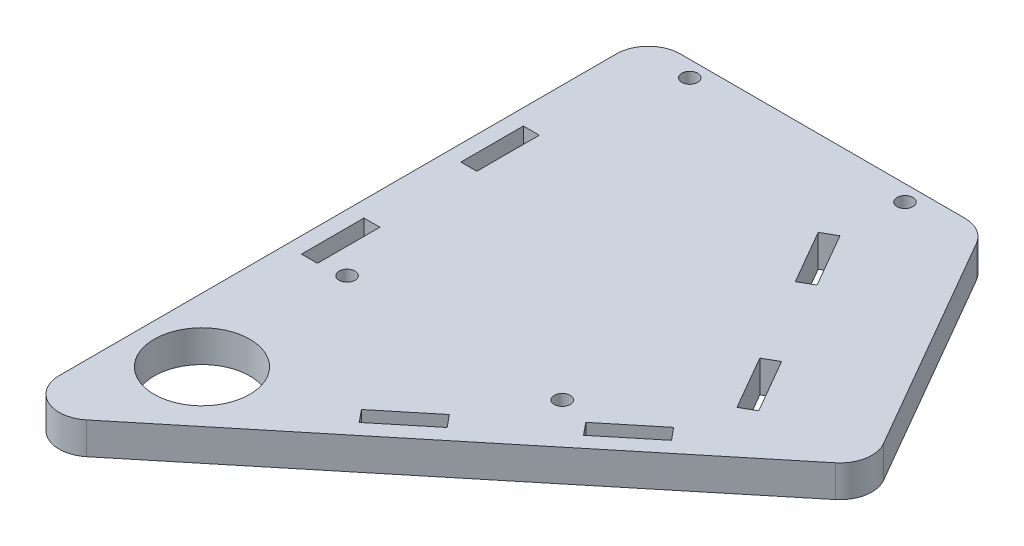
ISO-10303-21;
HEADER;
FILE_DESCRIPTION(('STEP AP214'),'2;1');
FILE_NAME('part.step','',(''),(''),'','','');
FILE_SCHEMA(('AUTOMOTIVE_DESIGN { 1 0 10303 214 1 1 1 1 }'));
ENDSEC;
DATA;
#1=APPLICATION_CONTEXT('core data for automotive mechanical design processes');
#2=APPLICATION_PROTOCOL_DEFINITION('international standard','automotive_design',2000,#1);
#3=PRODUCT_CONTEXT('',#1,'mechanical');
#4=PRODUCT('Part','Part','',(#3));
#5=PRODUCT_RELATED_PRODUCT_CATEGORY('part','',(#4));
#6=PRODUCT_DEFINITION_FORMATION('','',#4);
#7=PRODUCT_DEFINITION_CONTEXT('part definition',#1,'design');
#8=PRODUCT_DEFINITION('design','',#6,#7);
#9=PRODUCT_DEFINITION_SHAPE('','',#8);
#10=(LENGTH_UNIT() NAMED_UNIT(*) SI_UNIT(.MILLI.,.METRE.));
#11=(NAMED_UNIT(*) PLANE_ANGLE_UNIT() SI_UNIT($,.RADIAN.));
#12=(NAMED_UNIT(*) SI_UNIT($,.STERADIAN.) SOLID_ANGLE_UNIT());
#13=UNCERTAINTY_MEASURE_WITH_UNIT(LENGTH_MEASURE(1.E-05),#10,'distance_accuracy_value','');
#14=(GEOMETRIC_REPRESENTATION_CONTEXT(3) GLOBAL_UNCERTAINTY_ASSIGNED_CONTEXT((#13)) GLOBAL_UNIT_ASSIGNED_CONTEXT((#10,
#11,#12)) REPRESENTATION_CONTEXT('',''));
#15=CARTESIAN_POINT('',(0.,0.,0.));
#16=DIRECTION('',(0.,0.,1.));
#17=DIRECTION('',(1.,0.,0.));
#18=AXIS2_PLACEMENT_3D('',#15,#16,#17);
#19=CARTESIAN_POINT('',(-146.05,6.35,-187.458546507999));
#20=DIRECTION('',(0.,1.,0.));
#21=DIRECTION('',(0.,0.,1.));
#22=AXIS2_PLACEMENT_3D('',#19,#20,#21);
#23=PLANE('',#22);
#24=DIRECTION('',(0.633888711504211,0.,0.773424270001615));
#25=VECTOR('',#24,1.);
#26=CARTESIAN_POINT('',(-91.8981940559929,6.35,-231.840679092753));
#27=LINE('',#26,#25);
#28=CARTESIAN_POINT('',(-91.8981940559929,6.35,-231.840679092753));
#29=VERTEX_POINT('',#28);
#30=CARTESIAN_POINT('',(-89.8855973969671,6.35,-229.385057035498));
#31=VERTEX_POINT('',#30);
#32=EDGE_CURVE('E278',#29,#31,#27,.T.);
#33=ORIENTED_EDGE('',*,*,#32,.F.);
#34=DIRECTION('',(-0.773424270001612,0.,0.633888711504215));
#35=VECTOR('',#34,1.);
#36=CARTESIAN_POINT('',(-82.2721555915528,6.35,-239.730057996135));
#37=LINE('',#36,#35);
#38=CARTESIAN_POINT('',(-82.2721555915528,6.35,-239.730057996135));
#39=VERTEX_POINT('',#38);
#40=EDGE_CURVE('E276',#39,#29,#37,.T.);
#41=ORIENTED_EDGE('',*,*,#40,.F.);
#42=DIRECTION('',(-0.633888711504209,0.,-0.773424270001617));
#43=VECTOR('',#42,1.);
#44=CARTESIAN_POINT('',(-82.2721555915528,6.35,-239.730057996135));
#45=LINE('',#44,#43);
#46=CARTESIAN_POINT('',(-80.259558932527,6.35,-237.27443593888));
#47=VERTEX_POINT('',#46);
#48=EDGE_CURVE('E284',#47,#39,#45,.T.);
#49=ORIENTED_EDGE('',*,*,#48,.F.);
#50=DIRECTION('',(0.773424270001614,0.,-0.633888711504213));
#51=VECTOR('',#50,1.);
#52=CARTESIAN_POINT('',(-80.259558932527,6.35,-237.27443593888));
#53=LINE('',#52,#51);
#54=EDGE_CURVE('E281',#31,#47,#53,.T.);
#55=ORIENTED_EDGE('',*,*,#54,.F.);
#56=EDGE_LOOP('',(#33,#41,#49,#55));
#57=FACE_BOUND('',#56,.T.);
#58=DIRECTION('',(0.866025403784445,0.,-0.499999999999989));
#59=VECTOR('',#58,1.);
#60=CARTESIAN_POINT('',(-95.2945841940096,6.35,-276.968554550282));
#61=LINE('',#60,#59);
#62=CARTESIAN_POINT('',(-95.2945841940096,6.35,-276.968554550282));
#63=VERTEX_POINT('',#62);
#64=CARTESIAN_POINT('',(-92.544953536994,6.35,-278.556054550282));
#65=VERTEX_POINT('',#64);
#66=EDGE_CURVE('E340',#63,#65,#61,.T.);
#67=ORIENTED_EDGE('',*,*,#66,.F.);
#68=DIRECTION('',(0.500000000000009,0.,0.866025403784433));
#69=VECTOR('',#68,1.);
#70=CARTESIAN_POINT('',(-101.51758419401,6.35,-287.747106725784));
#71=LINE('',#70,#69);
#72=CARTESIAN_POINT('',(-101.51758419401,6.35,-287.747106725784));
#73=VERTEX_POINT('',#72);
#74=EDGE_CURVE('E338',#73,#63,#71,.T.);
#75=ORIENTED_EDGE('',*,*,#74,.F.);
#76=DIRECTION('',(-0.866025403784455,0.,0.499999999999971));
#77=VECTOR('',#76,1.);
#78=CARTESIAN_POINT('',(-101.51758419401,6.35,-287.747106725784));
#79=LINE('',#78,#77);
#80=CARTESIAN_POINT('',(-98.7679535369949,6.35,-289.334606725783));
#81=VERTEX_POINT('',#80);
#82=EDGE_CURVE('E346',#81,#73,#79,.T.);
#83=ORIENTED_EDGE('',*,*,#82,.F.);
#84=DIRECTION('',(-0.500000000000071,0.,-0.866025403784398));
#85=VECTOR('',#84,1.);
#86=CARTESIAN_POINT('',(-98.7679535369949,6.35,-289.334606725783));
#87=LINE('',#86,#85);
#88=EDGE_CURVE('E343',#65,#81,#87,.T.);
#89=ORIENTED_EDGE('',*,*,#88,.F.);
#90=EDGE_LOOP('',(#67,#75,#83,#89));
#91=FACE_BOUND('',#90,.T.);
#92=DIRECTION('',(1.,0.,2.09805925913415E-13));
#93=VECTOR('',#92,1.);
#94=CARTESIAN_POINT('',(-149.225000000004,6.35,-264.296354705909));
#95=LINE('',#94,#93);
#96=CARTESIAN_POINT('',(-149.225000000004,6.35,-264.296354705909));
#97=VERTEX_POINT('',#96);
#98=CARTESIAN_POINT('',(-146.050000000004,6.35,-264.296354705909));
#99=VERTEX_POINT('',#98);
#100=EDGE_CURVE('E402',#97,#99,#95,.T.);
#101=ORIENTED_EDGE('',*,*,#100,.F.);
#102=DIRECTION('',(0.,0.,1.));
#103=VECTOR('',#102,1.);
#104=CARTESIAN_POINT('',(-149.225000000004,6.35,-276.742354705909));
#105=LINE('',#104,#103);
#106=CARTESIAN_POINT('',(-149.225000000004,6.35,-276.742354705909));
#107=VERTEX_POINT('',#106);
#108=EDGE_CURVE('E400',#107,#97,#105,.T.);
#109=ORIENTED_EDGE('',*,*,#108,.F.);
#110=DIRECTION('',(-1.,0.,-1.92322098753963E-13));
#111=VECTOR('',#110,1.);
#112=CARTESIAN_POINT('',(-149.225000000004,6.35,-276.742354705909));
#113=LINE('',#112,#111);
#114=CARTESIAN_POINT('',(-146.050000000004,6.35,-276.742354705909));
#115=VERTEX_POINT('',#114);
#116=EDGE_CURVE('E408',#115,#107,#113,.T.);
#117=ORIENTED_EDGE('',*,*,#116,.F.);
#118=DIRECTION('',(0.,0.,-1.));
#119=VECTOR('',#118,1.);
#120=CARTESIAN_POINT('',(-146.050000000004,6.35,-276.742354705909));
#121=LINE('',#120,#119);
#122=EDGE_CURVE('E405',#99,#115,#121,.T.);
#123=ORIENTED_EDGE('',*,*,#122,.F.);
#124=EDGE_LOOP('',(#101,#109,#117,#123));
#125=FACE_BOUND('',#124,.T.);
#126=CARTESIAN_POINT('',(-98.1075000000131,6.35,-233.362500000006));
#127=DIRECTION('',(0.,1.,0.));
#128=DIRECTION('',(0.,0.,1.));
#129=AXIS2_PLACEMENT_3D('',#126,#127,#128);
#130=CIRCLE('',#129,1.5875);
#131=CARTESIAN_POINT('',(-98.1075000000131,6.35,-231.775000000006));
#132=VERTEX_POINT('',#131);
#133=EDGE_CURVE('E437',#132,#132,#130,.T.);
#134=ORIENTED_EDGE('',*,*,#133,.F.);
#135=EDGE_LOOP('',(#134));
#136=FACE_BOUND('',#135,.T.);
#137=CARTESIAN_POINT('',(-140.970000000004,6.35,-233.362500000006));
#138=DIRECTION('',(0.,1.,0.));
#139=DIRECTION('',(0.,0.,1.));
#140=AXIS2_PLACEMENT_3D('',#137,#138,#139);
#141=CIRCLE('',#140,1.58749999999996);
#142=CARTESIAN_POINT('',(-140.970000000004,6.35,-231.775000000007));
#143=VERTEX_POINT('',#142);
#144=EDGE_CURVE('E449',#143,#143,#141,.T.);
#145=ORIENTED_EDGE('',*,*,#144,.F.);
#146=EDGE_LOOP('',(#145));
#147=FACE_BOUND('',#146,.T.);
#148=CARTESIAN_POINT('',(-146.05,6.35,-187.458546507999));
#149=DIRECTION('',(0.,1.,0.));
#150=DIRECTION('',(0.,0.,1.));
#151=AXIS2_PLACEMENT_3D('',#148,#149,#150);
#152=CIRCLE('',#151,6.34999999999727);
#153=CARTESIAN_POINT('',(-152.4,6.35,-187.458546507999));
#154=VERTEX_POINT('',#153);
#155=CARTESIAN_POINT('',(-142.024806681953,6.35,-182.547302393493));
#156=VERTEX_POINT('',#155);
#157=EDGE_CURVE('E461',#154,#156,#152,.T.);
#158=ORIENTED_EDGE('',*,*,#157,.T.);
#159=DIRECTION('',(0.773424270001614,0.,-0.633888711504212));
#160=VECTOR('',#159,1.);
#161=CARTESIAN_POINT('',(-130.626546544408,6.35,-191.889171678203));
#162=LINE('',#161,#160);
#163=CARTESIAN_POINT('',(-60.0496370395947,6.35,-249.733110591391));
#164=VERTEX_POINT('',#163);
#165=EDGE_CURVE('E464',#156,#164,#162,.T.);
#166=ORIENTED_EDGE('',*,*,#165,.T.);
#167=CARTESIAN_POINT('',(-64.0748303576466,6.35,-254.644354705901));
#168=DIRECTION('',(0.,1.,0.));
#169=DIRECTION('',(0.,0.,-1.));
#170=AXIS2_PLACEMENT_3D('',#167,#168,#169);
#171=CIRCLE('',#170,6.35000000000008);
#172=CARTESIAN_POINT('',(-58.5755690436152,6.35,-257.819354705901));
#173=VERTEX_POINT('',#172);
#174=EDGE_CURVE('E467',#164,#173,#171,.T.);
#175=ORIENTED_EDGE('',*,*,#174,.T.);
#176=DIRECTION('',(-0.499999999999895,0.,-0.866025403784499));
#177=VECTOR('',#176,1.);
#178=CARTESIAN_POINT('',(-58.5755690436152,6.35,-257.819354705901));
#179=LINE('',#178,#177);
#180=CARTESIAN_POINT('',(-83.866770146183,6.35,-301.625000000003));
#181=VERTEX_POINT('',#180);
#182=EDGE_CURVE('E469',#173,#181,#179,.T.);
#183=ORIENTED_EDGE('',*,*,#182,.T.);
#184=CARTESIAN_POINT('',(-89.3660314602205,6.35,-298.449999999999));
#185=DIRECTION('',(0.,1.,0.));
#186=DIRECTION('',(0.,0.,-1.));
#187=AXIS2_PLACEMENT_3D('',#184,#185,#186);
#188=CIRCLE('',#187,6.35000000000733);
#189=CARTESIAN_POINT('',(-89.366031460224,6.35,-304.800000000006));
#190=VERTEX_POINT('',#189);
#191=EDGE_CURVE('E471',#181,#190,#188,.T.);
#192=ORIENTED_EDGE('',*,*,#191,.T.);
#193=DIRECTION('',(-1.,0.,0.));
#194=VECTOR('',#193,1.);
#195=CARTESIAN_POINT('',(-146.050000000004,6.35,-304.800000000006));
#196=LINE('',#195,#194);
#197=CARTESIAN_POINT('',(-146.050000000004,6.35,-304.800000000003));
#198=VERTEX_POINT('',#197);
#199=EDGE_CURVE('E473',#190,#198,#196,.T.);
#200=ORIENTED_EDGE('',*,*,#199,.T.);
#201=CARTESIAN_POINT('',(-146.05,6.35,-298.45));
#202=DIRECTION('',(0.,1.,0.));
#203=DIRECTION('',(0.,0.,-1.));
#204=AXIS2_PLACEMENT_3D('',#201,#202,#203);
#205=CIRCLE('',#204,6.35000000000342);
#206=CARTESIAN_POINT('',(-152.4,6.35,-298.45));
#207=VERTEX_POINT('',#206);
#208=EDGE_CURVE('E475',#198,#207,#205,.T.);
#209=ORIENTED_EDGE('',*,*,#208,.T.);
#210=DIRECTION('',(0.,0.,1.));
#211=VECTOR('',#210,1.);
#212=CARTESIAN_POINT('',(-152.4,6.35,-187.458546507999));
#213=LINE('',#212,#211);
#214=EDGE_CURVE('E477',#207,#154,#213,.T.);
#215=ORIENTED_EDGE('',*,*,#214,.T.);
#216=EDGE_LOOP('',(#158,#166,#175,#183,#192,#200,#209,#215));
#217=FACE_BOUND('',#216,.T.);
#218=CARTESIAN_POINT('',(-140.970000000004,6.35,-301.625000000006));
#219=DIRECTION('',(0.,1.,0.));
#220=DIRECTION('',(0.,0.,1.));
#221=AXIS2_PLACEMENT_3D('',#218,#219,#220);
#222=CIRCLE('',#221,1.58749999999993);
#223=CARTESIAN_POINT('',(-140.970000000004,6.35,-300.037500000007));
#224=VERTEX_POINT('',#223);
#225=EDGE_CURVE('E455',#224,#224,#222,.T.);
#226=ORIENTED_EDGE('',*,*,#225,.F.);
#227=EDGE_LOOP('',(#226));
#228=FACE_BOUND('',#227,.T.);
#229=CARTESIAN_POINT('',(-98.1075000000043,6.35,-301.625000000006));
#230=DIRECTION('',(0.,1.,0.));
#231=DIRECTION('',(0.,0.,1.));
#232=AXIS2_PLACEMENT_3D('',#229,#230,#231);
#233=CIRCLE('',#232,1.58749999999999);
#234=CARTESIAN_POINT('',(-98.1075000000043,6.35,-300.037500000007));
#235=VERTEX_POINT('',#234);
#236=EDGE_CURVE('E443',#235,#235,#233,.T.);
#237=ORIENTED_EDGE('',*,*,#236,.F.);
#238=EDGE_LOOP('',(#237));
#239=FACE_BOUND('',#238,.T.);
#240=CARTESIAN_POINT('',(-139.700000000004,6.35,-203.200000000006));
#241=DIRECTION('',(0.,1.,0.));
#242=DIRECTION('',(0.,0.,1.));
#243=AXIS2_PLACEMENT_3D('',#240,#241,#242);
#244=CIRCLE('',#243,9.52499999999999);
#245=CARTESIAN_POINT('',(-139.700000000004,6.35,-193.675000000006));
#246=VERTEX_POINT('',#245);
#247=EDGE_CURVE('E431',#246,#246,#244,.T.);
#248=ORIENTED_EDGE('',*,*,#247,.F.);
#249=EDGE_LOOP('',(#248));
#250=FACE_BOUND('',#249,.T.);
#251=DIRECTION('',(0.,0.,-1.));
#252=VECTOR('',#251,1.);
#253=CARTESIAN_POINT('',(-146.050000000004,6.35,-232.546354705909));
#254=LINE('',#253,#252);
#255=CARTESIAN_POINT('',(-146.050000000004,6.35,-232.546354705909));
#256=VERTEX_POINT('',#255);
#257=CARTESIAN_POINT('',(-146.050000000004,6.35,-244.992354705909));
#258=VERTEX_POINT('',#257);
#259=EDGE_CURVE('E371',#256,#258,#254,.T.);
#260=ORIENTED_EDGE('',*,*,#259,.F.);
#261=DIRECTION('',(1.,0.,2.36031666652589E-13));
#262=VECTOR('',#261,1.);
#263=CARTESIAN_POINT('',(-149.225000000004,6.35,-232.546354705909));
#264=LINE('',#263,#262);
#265=CARTESIAN_POINT('',(-149.225000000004,6.35,-232.546354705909));
#266=VERTEX_POINT('',#265);
#267=EDGE_CURVE('E369',#266,#256,#264,.T.);
#268=ORIENTED_EDGE('',*,*,#267,.F.);
#269=DIRECTION('',(0.,0.,1.));
#270=VECTOR('',#269,1.);
#271=CARTESIAN_POINT('',(-149.225000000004,6.35,-232.546354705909));
#272=LINE('',#271,#270);
#273=CARTESIAN_POINT('',(-149.225000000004,6.35,-244.992354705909));
#274=VERTEX_POINT('',#273);
#275=EDGE_CURVE('E377',#274,#266,#272,.T.);
#276=ORIENTED_EDGE('',*,*,#275,.F.);
#277=DIRECTION('',(-1.,0.,-2.09805925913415E-13));
#278=VECTOR('',#277,1.);
#279=CARTESIAN_POINT('',(-149.225000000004,6.35,-244.992354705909));
#280=LINE('',#279,#278);
#281=EDGE_CURVE('E374',#258,#274,#280,.T.);
#282=ORIENTED_EDGE('',*,*,#281,.F.);
#283=EDGE_LOOP('',(#260,#268,#276,#282));
#284=FACE_BOUND('',#283,.T.);
#285=DIRECTION('',(-0.499999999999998,0.,-0.86602540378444));
#286=VECTOR('',#285,1.);
#287=CARTESIAN_POINT('',(-76.6699535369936,6.35,-251.059747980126));
#288=LINE('',#287,#286);
#289=CARTESIAN_POINT('',(-76.6699535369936,6.35,-251.059747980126));
#290=VERTEX_POINT('',#289);
#291=CARTESIAN_POINT('',(-82.8929535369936,6.35,-261.838300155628));
#292=VERTEX_POINT('',#291);
#293=EDGE_CURVE('E309',#290,#292,#288,.T.);
#294=ORIENTED_EDGE('',*,*,#293,.F.);
#295=DIRECTION('',(0.866025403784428,0.,-0.500000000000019));
#296=VECTOR('',#295,1.);
#297=CARTESIAN_POINT('',(-79.4195841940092,6.35,-249.472247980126));
#298=LINE('',#297,#296);
#299=CARTESIAN_POINT('',(-79.4195841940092,6.35,-249.472247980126));
#300=VERTEX_POINT('',#299);
#301=EDGE_CURVE('E307',#300,#290,#298,.T.);
#302=ORIENTED_EDGE('',*,*,#301,.F.);
#303=DIRECTION('',(0.500000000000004,0.,0.866025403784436));
#304=VECTOR('',#303,1.);
#305=CARTESIAN_POINT('',(-79.4195841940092,6.35,-249.472247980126));
#306=LINE('',#305,#304);
#307=CARTESIAN_POINT('',(-85.6425841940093,6.35,-260.250800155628));
#308=VERTEX_POINT('',#307);
#309=EDGE_CURVE('E315',#308,#300,#306,.T.);
#310=ORIENTED_EDGE('',*,*,#309,.F.);
#311=DIRECTION('',(-0.866025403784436,0.,0.500000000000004));
#312=VECTOR('',#311,1.);
#313=CARTESIAN_POINT('',(-85.6425841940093,6.35,-260.250800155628));
#314=LINE('',#313,#312);
#315=EDGE_CURVE('E312',#292,#308,#314,.T.);
#316=ORIENTED_EDGE('',*,*,#315,.F.);
#317=EDGE_LOOP('',(#294,#302,#310,#316));
#318=FACE_BOUND('',#317,.T.);
#319=DIRECTION('',(0.773424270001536,0.,-0.633888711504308));
#320=VECTOR('',#319,1.);
#321=CARTESIAN_POINT('',(-114.441817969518,6.35,-209.25909044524));
#322=LINE('',#321,#320);
#323=CARTESIAN_POINT('',(-114.441817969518,6.35,-209.25909044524));
#324=VERTEX_POINT('',#323);
#325=CARTESIAN_POINT('',(-104.815779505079,6.35,-217.148469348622));
#326=VERTEX_POINT('',#325);
#327=EDGE_CURVE('E248',#324,#326,#322,.T.);
#328=ORIENTED_EDGE('',*,*,#327,.F.);
#329=DIRECTION('',(0.633888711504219,0.,0.773424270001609));
#330=VECTOR('',#329,1.);
#331=CARTESIAN_POINT('',(-116.454414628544,6.35,-211.714712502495));
#332=LINE('',#331,#330);
#333=CARTESIAN_POINT('',(-116.454414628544,6.35,-211.714712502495));
#334=VERTEX_POINT('',#333);
#335=EDGE_CURVE('E240',#334,#324,#332,.T.);
#336=ORIENTED_EDGE('',*,*,#335,.F.);
#337=DIRECTION('',(-0.773424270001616,0.,0.63388871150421));
#338=VECTOR('',#337,1.);
#339=CARTESIAN_POINT('',(-116.454414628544,6.35,-211.714712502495));
#340=LINE('',#339,#338);
#341=CARTESIAN_POINT('',(-106.828376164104,6.35,-219.604091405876));
#342=VERTEX_POINT('',#341);
#343=EDGE_CURVE('E262',#342,#334,#340,.T.);
#344=ORIENTED_EDGE('',*,*,#343,.F.);
#345=DIRECTION('',(-0.633888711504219,0.,-0.773424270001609));
#346=VECTOR('',#345,1.);
#347=CARTESIAN_POINT('',(-106.828376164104,6.35,-219.604091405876));
#348=LINE('',#347,#346);
#349=EDGE_CURVE('E260',#326,#342,#348,.T.);
#350=ORIENTED_EDGE('',*,*,#349,.F.);
#351=EDGE_LOOP('',(#328,#336,#344,#350));
#352=FACE_BOUND('',#351,.T.);
#353=ADVANCED_FACE('F31',(#57,#91,#125,#136,#147,#217,#228,#239,#250,#284,#318,#352),#23,.T.);
#354=CARTESIAN_POINT('',(-146.05,0.,-187.458546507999));
#355=DIRECTION('',(0.,1.,0.));
#356=DIRECTION('',(0.,0.,1.));
#357=AXIS2_PLACEMENT_3D('',#354,#355,#356);
#358=PLANE('',#357);
#359=DIRECTION('',(-0.773424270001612,0.,0.633888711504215));
#360=VECTOR('',#359,1.);
#361=CARTESIAN_POINT('',(-82.2721555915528,0.,-239.730057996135));
#362=LINE('',#361,#360);
#363=CARTESIAN_POINT('',(-82.2721555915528,0.,-239.730057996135));
#364=VERTEX_POINT('',#363);
#365=CARTESIAN_POINT('',(-91.8981940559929,0.,-231.840679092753));
#366=VERTEX_POINT('',#365);
#367=EDGE_CURVE('E256',#364,#366,#362,.T.);
#368=ORIENTED_EDGE('',*,*,#367,.T.);
#369=DIRECTION('',(0.633888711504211,0.,0.773424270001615));
#370=VECTOR('',#369,1.);
#371=CARTESIAN_POINT('',(-91.8981940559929,0.,-231.840679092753));
#372=LINE('',#371,#370);
#373=CARTESIAN_POINT('',(-89.8855973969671,0.,-229.385057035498));
#374=VERTEX_POINT('',#373);
#375=EDGE_CURVE('E289',#366,#374,#372,.T.);
#376=ORIENTED_EDGE('',*,*,#375,.T.);
#377=DIRECTION('',(0.773424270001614,0.,-0.633888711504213));
#378=VECTOR('',#377,1.);
#379=CARTESIAN_POINT('',(-80.259558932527,0.,-237.27443593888));
#380=LINE('',#379,#378);
#381=CARTESIAN_POINT('',(-80.259558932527,0.,-237.27443593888));
#382=VERTEX_POINT('',#381);
#383=EDGE_CURVE('E292',#374,#382,#380,.T.);
#384=ORIENTED_EDGE('',*,*,#383,.T.);
#385=DIRECTION('',(-0.633888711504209,0.,-0.773424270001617));
#386=VECTOR('',#385,1.);
#387=CARTESIAN_POINT('',(-82.2721555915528,0.,-239.730057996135));
#388=LINE('',#387,#386);
#389=EDGE_CURVE('E279',#382,#364,#388,.T.);
#390=ORIENTED_EDGE('',*,*,#389,.T.);
#391=EDGE_LOOP('',(#368,#376,#384,#390));
#392=FACE_BOUND('',#391,.T.);
#393=DIRECTION('',(0.500000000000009,0.,0.866025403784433));
#394=VECTOR('',#393,1.);
#395=CARTESIAN_POINT('',(-101.51758419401,0.,-287.747106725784));
#396=LINE('',#395,#394);
#397=CARTESIAN_POINT('',(-101.51758419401,0.,-287.747106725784));
#398=VERTEX_POINT('',#397);
#399=CARTESIAN_POINT('',(-95.2945841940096,0.,-276.968554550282));
#400=VERTEX_POINT('',#399);
#401=EDGE_CURVE('E337',#398,#400,#396,.T.);
#402=ORIENTED_EDGE('',*,*,#401,.T.);
#403=DIRECTION('',(0.866025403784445,0.,-0.499999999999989));
#404=VECTOR('',#403,1.);
#405=CARTESIAN_POINT('',(-95.2945841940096,0.,-276.968554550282));
#406=LINE('',#405,#404);
#407=CARTESIAN_POINT('',(-92.544953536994,0.,-278.556054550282));
#408=VERTEX_POINT('',#407);
#409=EDGE_CURVE('E351',#400,#408,#406,.T.);
#410=ORIENTED_EDGE('',*,*,#409,.T.);
#411=DIRECTION('',(-0.500000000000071,0.,-0.866025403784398));
#412=VECTOR('',#411,1.);
#413=CARTESIAN_POINT('',(-98.7679535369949,0.,-289.334606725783));
#414=LINE('',#413,#412);
#415=CARTESIAN_POINT('',(-98.7679535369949,0.,-289.334606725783));
#416=VERTEX_POINT('',#415);
#417=EDGE_CURVE('E354',#408,#416,#414,.T.);
#418=ORIENTED_EDGE('',*,*,#417,.T.);
#419=DIRECTION('',(-0.866025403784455,0.,0.499999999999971));
#420=VECTOR('',#419,1.);
#421=CARTESIAN_POINT('',(-101.51758419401,0.,-287.747106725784));
#422=LINE('',#421,#420);
#423=EDGE_CURVE('E341',#416,#398,#422,.T.);
#424=ORIENTED_EDGE('',*,*,#423,.T.);
#425=EDGE_LOOP('',(#402,#410,#418,#424));
#426=FACE_BOUND('',#425,.T.);
#427=DIRECTION('',(0.,0.,1.));
#428=VECTOR('',#427,1.);
#429=CARTESIAN_POINT('',(-149.225000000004,0.,-276.742354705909));
#430=LINE('',#429,#428);
#431=CARTESIAN_POINT('',(-149.225000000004,0.,-276.742354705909));
#432=VERTEX_POINT('',#431);
#433=CARTESIAN_POINT('',(-149.225000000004,0.,-264.296354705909));
#434=VERTEX_POINT('',#433);
#435=EDGE_CURVE('E399',#432,#434,#430,.T.);
#436=ORIENTED_EDGE('',*,*,#435,.T.);
#437=DIRECTION('',(1.,0.,2.09805925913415E-13));
#438=VECTOR('',#437,1.);
#439=CARTESIAN_POINT('',(-149.225000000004,0.,-264.296354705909));
#440=LINE('',#439,#438);
#441=CARTESIAN_POINT('',(-146.050000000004,0.,-264.296354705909));
#442=VERTEX_POINT('',#441);
#443=EDGE_CURVE('E413',#434,#442,#440,.T.);
#444=ORIENTED_EDGE('',*,*,#443,.T.);
#445=DIRECTION('',(0.,0.,-1.));
#446=VECTOR('',#445,1.);
#447=CARTESIAN_POINT('',(-146.050000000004,0.,-276.742354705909));
#448=LINE('',#447,#446);
#449=CARTESIAN_POINT('',(-146.050000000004,0.,-276.742354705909));
#450=VERTEX_POINT('',#449);
#451=EDGE_CURVE('E416',#442,#450,#448,.T.);
#452=ORIENTED_EDGE('',*,*,#451,.T.);
#453=DIRECTION('',(-1.,0.,-1.92322098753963E-13));
#454=VECTOR('',#453,1.);
#455=CARTESIAN_POINT('',(-149.225000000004,0.,-276.742354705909));
#456=LINE('',#455,#454);
#457=EDGE_CURVE('E403',#450,#432,#456,.T.);
#458=ORIENTED_EDGE('',*,*,#457,.T.);
#459=EDGE_LOOP('',(#436,#444,#452,#458));
#460=FACE_BOUND('',#459,.T.);
#461=CARTESIAN_POINT('',(-98.1075000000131,0.,-233.362500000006));
#462=DIRECTION('',(0.,1.,0.));
#463=DIRECTION('',(0.,0.,1.));
#464=AXIS2_PLACEMENT_3D('',#461,#462,#463);
#465=CIRCLE('',#464,1.5875);
#466=CARTESIAN_POINT('',(-98.1075000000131,0.,-231.775000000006));
#467=VERTEX_POINT('',#466);
#468=EDGE_CURVE('E434',#467,#467,#465,.T.);
#469=ORIENTED_EDGE('',*,*,#468,.T.);
#470=EDGE_LOOP('',(#469));
#471=FACE_BOUND('',#470,.T.);
#472=CARTESIAN_POINT('',(-140.970000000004,0.,-233.362500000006));
#473=DIRECTION('',(0.,1.,0.));
#474=DIRECTION('',(0.,0.,1.));
#475=AXIS2_PLACEMENT_3D('',#472,#473,#474);
#476=CIRCLE('',#475,1.58749999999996);
#477=CARTESIAN_POINT('',(-140.970000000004,0.,-231.775000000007));
#478=VERTEX_POINT('',#477);
#479=EDGE_CURVE('E446',#478,#478,#476,.T.);
#480=ORIENTED_EDGE('',*,*,#479,.T.);
#481=EDGE_LOOP('',(#480));
#482=FACE_BOUND('',#481,.T.);
#483=CARTESIAN_POINT('',(-146.05,0.,-187.458546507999));
#484=DIRECTION('',(0.,1.,0.));
#485=DIRECTION('',(0.,0.,1.));
#486=AXIS2_PLACEMENT_3D('',#483,#484,#485);
#487=CIRCLE('',#486,6.34999999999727);
#488=CARTESIAN_POINT('',(-152.4,0.,-187.458546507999));
#489=VERTEX_POINT('',#488);
#490=CARTESIAN_POINT('',(-142.024806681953,0.,-182.547302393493));
#491=VERTEX_POINT('',#490);
#492=EDGE_CURVE('E458',#489,#491,#487,.T.);
#493=ORIENTED_EDGE('',*,*,#492,.F.);
#494=DIRECTION('',(0.,0.,1.));
#495=VECTOR('',#494,1.);
#496=CARTESIAN_POINT('',(-152.4,0.,-187.458546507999));
#497=LINE('',#496,#495);
#498=CARTESIAN_POINT('',(-152.4,0.,-298.45));
#499=VERTEX_POINT('',#498);
#500=EDGE_CURVE('E465',#499,#489,#497,.T.);
#501=ORIENTED_EDGE('',*,*,#500,.F.);
#502=CARTESIAN_POINT('',(-146.05,0.,-298.45));
#503=DIRECTION('',(0.,1.,0.));
#504=DIRECTION('',(0.,0.,-1.));
#505=AXIS2_PLACEMENT_3D('',#502,#503,#504);
#506=CIRCLE('',#505,6.35000000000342);
#507=CARTESIAN_POINT('',(-146.050000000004,0.,-304.800000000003));
#508=VERTEX_POINT('',#507);
#509=EDGE_CURVE('E492',#508,#499,#506,.T.);
#510=ORIENTED_EDGE('',*,*,#509,.F.);
#511=DIRECTION('',(-1.,0.,0.));
#512=VECTOR('',#511,1.);
#513=CARTESIAN_POINT('',(-146.050000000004,0.,-304.800000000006));
#514=LINE('',#513,#512);
#515=CARTESIAN_POINT('',(-89.366031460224,0.,-304.800000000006));
#516=VERTEX_POINT('',#515);
#517=EDGE_CURVE('E490',#516,#508,#514,.T.);
#518=ORIENTED_EDGE('',*,*,#517,.F.);
#519=CARTESIAN_POINT('',(-89.3660314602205,0.,-298.449999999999));
#520=DIRECTION('',(0.,1.,0.));
#521=DIRECTION('',(0.,0.,-1.));
#522=AXIS2_PLACEMENT_3D('',#519,#520,#521);
#523=CIRCLE('',#522,6.35000000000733);
#524=CARTESIAN_POINT('',(-83.866770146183,0.,-301.625000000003));
#525=VERTEX_POINT('',#524);
#526=EDGE_CURVE('E488',#525,#516,#523,.T.);
#527=ORIENTED_EDGE('',*,*,#526,.F.);
#528=DIRECTION('',(-0.499999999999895,0.,-0.866025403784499));
#529=VECTOR('',#528,1.);
#530=CARTESIAN_POINT('',(-58.5755690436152,0.,-257.819354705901));
#531=LINE('',#530,#529);
#532=CARTESIAN_POINT('',(-58.5755690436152,0.,-257.819354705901));
#533=VERTEX_POINT('',#532);
#534=EDGE_CURVE('E486',#533,#525,#531,.T.);
#535=ORIENTED_EDGE('',*,*,#534,.F.);
#536=CARTESIAN_POINT('',(-64.0748303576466,0.,-254.644354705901));
#537=DIRECTION('',(0.,1.,0.));
#538=DIRECTION('',(0.,0.,-1.));
#539=AXIS2_PLACEMENT_3D('',#536,#537,#538);
#540=CIRCLE('',#539,6.35000000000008);
#541=CARTESIAN_POINT('',(-60.0496370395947,0.,-249.733110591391));
#542=VERTEX_POINT('',#541);
#543=EDGE_CURVE('E484',#542,#533,#540,.T.);
#544=ORIENTED_EDGE('',*,*,#543,.F.);
#545=DIRECTION('',(0.773424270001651,0.,-0.633888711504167));
#546=VECTOR('',#545,1.);
#547=CARTESIAN_POINT('',(-60.0496370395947,0.,-249.733110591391));
#548=LINE('',#547,#546);
#549=EDGE_CURVE('E482',#491,#542,#548,.T.);
#550=ORIENTED_EDGE('',*,*,#549,.F.);
#551=EDGE_LOOP('',(#493,#501,#510,#518,#527,#535,#544,#550));
#552=FACE_BOUND('',#551,.T.);
#553=CARTESIAN_POINT('',(-140.970000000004,0.,-301.625000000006));
#554=DIRECTION('',(0.,1.,0.));
#555=DIRECTION('',(0.,0.,1.));
#556=AXIS2_PLACEMENT_3D('',#553,#554,#555);
#557=CIRCLE('',#556,1.58749999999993);
#558=CARTESIAN_POINT('',(-140.970000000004,0.,-300.037500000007));
#559=VERTEX_POINT('',#558);
#560=EDGE_CURVE('E452',#559,#559,#557,.T.);
#561=ORIENTED_EDGE('',*,*,#560,.T.);
#562=EDGE_LOOP('',(#561));
#563=FACE_BOUND('',#562,.T.);
#564=CARTESIAN_POINT('',(-98.1075000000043,0.,-301.625000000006));
#565=DIRECTION('',(0.,1.,0.));
#566=DIRECTION('',(0.,0.,1.));
#567=AXIS2_PLACEMENT_3D('',#564,#565,#566);
#568=CIRCLE('',#567,1.58749999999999);
#569=CARTESIAN_POINT('',(-98.1075000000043,0.,-300.037500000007));
#570=VERTEX_POINT('',#569);
#571=EDGE_CURVE('E440',#570,#570,#568,.T.);
#572=ORIENTED_EDGE('',*,*,#571,.T.);
#573=EDGE_LOOP('',(#572));
#574=FACE_BOUND('',#573,.T.);
#575=CARTESIAN_POINT('',(-139.700000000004,0.,-203.200000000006));
#576=DIRECTION('',(0.,1.,0.));
#577=DIRECTION('',(0.,0.,1.));
#578=AXIS2_PLACEMENT_3D('',#575,#576,#577);
#579=CIRCLE('',#578,9.52499999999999);
#580=CARTESIAN_POINT('',(-139.700000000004,0.,-193.675000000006));
#581=VERTEX_POINT('',#580);
#582=EDGE_CURVE('E430',#581,#581,#579,.T.);
#583=ORIENTED_EDGE('',*,*,#582,.T.);
#584=EDGE_LOOP('',(#583));
#585=FACE_BOUND('',#584,.T.);
#586=DIRECTION('',(1.,0.,2.36031666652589E-13));
#587=VECTOR('',#586,1.);
#588=CARTESIAN_POINT('',(-149.225000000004,0.,-232.546354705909));
#589=LINE('',#588,#587);
#590=CARTESIAN_POINT('',(-149.225000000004,0.,-232.546354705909));
#591=VERTEX_POINT('',#590);
#592=CARTESIAN_POINT('',(-146.050000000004,0.,-232.546354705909));
#593=VERTEX_POINT('',#592);
#594=EDGE_CURVE('E368',#591,#593,#589,.T.);
#595=ORIENTED_EDGE('',*,*,#594,.T.);
#596=DIRECTION('',(0.,0.,-1.));
#597=VECTOR('',#596,1.);
#598=CARTESIAN_POINT('',(-146.050000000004,0.,-232.546354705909));
#599=LINE('',#598,#597);
#600=CARTESIAN_POINT('',(-146.050000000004,0.,-244.992354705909));
#601=VERTEX_POINT('',#600);
#602=EDGE_CURVE('E382',#593,#601,#599,.T.);
#603=ORIENTED_EDGE('',*,*,#602,.T.);
#604=DIRECTION('',(-1.,0.,-2.09805925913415E-13));
#605=VECTOR('',#604,1.);
#606=CARTESIAN_POINT('',(-149.225000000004,0.,-244.992354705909));
#607=LINE('',#606,#605);
#608=CARTESIAN_POINT('',(-149.225000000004,0.,-244.992354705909));
#609=VERTEX_POINT('',#608);
#610=EDGE_CURVE('E385',#601,#609,#607,.T.);
#611=ORIENTED_EDGE('',*,*,#610,.T.);
#612=DIRECTION('',(0.,0.,1.));
#613=VECTOR('',#612,1.);
#614=CARTESIAN_POINT('',(-149.225000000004,0.,-232.546354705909));
#615=LINE('',#614,#613);
#616=EDGE_CURVE('E372',#609,#591,#615,.T.);
#617=ORIENTED_EDGE('',*,*,#616,.T.);
#618=EDGE_LOOP('',(#595,#603,#611,#617));
#619=FACE_BOUND('',#618,.T.);
#620=DIRECTION('',(0.866025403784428,0.,-0.500000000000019));
#621=VECTOR('',#620,1.);
#622=CARTESIAN_POINT('',(-79.4195841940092,0.,-249.472247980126));
#623=LINE('',#622,#621);
#624=CARTESIAN_POINT('',(-79.4195841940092,0.,-249.472247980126));
#625=VERTEX_POINT('',#624);
#626=CARTESIAN_POINT('',(-76.6699535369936,0.,-251.059747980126));
#627=VERTEX_POINT('',#626);
#628=EDGE_CURVE('E306',#625,#627,#623,.T.);
#629=ORIENTED_EDGE('',*,*,#628,.T.);
#630=DIRECTION('',(-0.499999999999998,0.,-0.86602540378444));
#631=VECTOR('',#630,1.);
#632=CARTESIAN_POINT('',(-76.6699535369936,0.,-251.059747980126));
#633=LINE('',#632,#631);
#634=CARTESIAN_POINT('',(-82.8929535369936,0.,-261.838300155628));
#635=VERTEX_POINT('',#634);
#636=EDGE_CURVE('E320',#627,#635,#633,.T.);
#637=ORIENTED_EDGE('',*,*,#636,.T.);
#638=DIRECTION('',(-0.866025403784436,0.,0.500000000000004));
#639=VECTOR('',#638,1.);
#640=CARTESIAN_POINT('',(-85.6425841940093,0.,-260.250800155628));
#641=LINE('',#640,#639);
#642=CARTESIAN_POINT('',(-85.6425841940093,0.,-260.250800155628));
#643=VERTEX_POINT('',#642);
#644=EDGE_CURVE('E323',#635,#643,#641,.T.);
#645=ORIENTED_EDGE('',*,*,#644,.T.);
#646=DIRECTION('',(0.500000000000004,0.,0.866025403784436));
#647=VECTOR('',#646,1.);
#648=CARTESIAN_POINT('',(-79.4195841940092,0.,-249.472247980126));
#649=LINE('',#648,#647);
#650=EDGE_CURVE('E310',#643,#625,#649,.T.);
#651=ORIENTED_EDGE('',*,*,#650,.T.);
#652=EDGE_LOOP('',(#629,#637,#645,#651));
#653=FACE_BOUND('',#652,.T.);
#654=DIRECTION('',(0.633888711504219,0.,0.773424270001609));
#655=VECTOR('',#654,1.);
#656=CARTESIAN_POINT('',(-116.454414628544,0.,-211.714712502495));
#657=LINE('',#656,#655);
#658=CARTESIAN_POINT('',(-116.454414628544,0.,-211.714712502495));
#659=VERTEX_POINT('',#658);
#660=CARTESIAN_POINT('',(-114.441817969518,0.,-209.25909044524));
#661=VERTEX_POINT('',#660);
#662=EDGE_CURVE('E54',#659,#661,#657,.T.);
#663=ORIENTED_EDGE('',*,*,#662,.T.);
#664=DIRECTION('',(0.773424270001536,0.,-0.633888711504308));
#665=VECTOR('',#664,1.);
#666=CARTESIAN_POINT('',(-114.441817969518,0.,-209.25909044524));
#667=LINE('',#666,#665);
#668=CARTESIAN_POINT('',(-104.815779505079,0.,-217.148469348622));
#669=VERTEX_POINT('',#668);
#670=EDGE_CURVE('E255',#661,#669,#667,.T.);
#671=ORIENTED_EDGE('',*,*,#670,.T.);
#672=DIRECTION('',(-0.633888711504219,0.,-0.773424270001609));
#673=VECTOR('',#672,1.);
#674=CARTESIAN_POINT('',(-106.828376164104,0.,-219.604091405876));
#675=LINE('',#674,#673);
#676=CARTESIAN_POINT('',(-106.828376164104,0.,-219.604091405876));
#677=VERTEX_POINT('',#676);
#678=EDGE_CURVE('E268',#669,#677,#675,.T.);
#679=ORIENTED_EDGE('',*,*,#678,.T.);
#680=DIRECTION('',(-0.773424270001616,0.,0.63388871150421));
#681=VECTOR('',#680,1.);
#682=CARTESIAN_POINT('',(-116.454414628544,0.,-211.714712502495));
#683=LINE('',#682,#681);
#684=EDGE_CURVE('E249',#677,#659,#683,.T.);
#685=ORIENTED_EDGE('',*,*,#684,.T.);
#686=EDGE_LOOP('',(#663,#671,#679,#685));
#687=FACE_BOUND('',#686,.T.);
#688=ADVANCED_FACE('F522',(#392,#426,#460,#471,#482,#552,#563,#574,#585,#619,#653,#687),#358,.F.);
#689=CARTESIAN_POINT('',(-146.05,6.35,-187.458546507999));
#690=DIRECTION('',(0.,-1.,0.));
#691=DIRECTION('',(0.,0.,-1.));
#692=AXIS2_PLACEMENT_3D('',#689,#690,#691);
#693=CYLINDRICAL_SURFACE('',#692,6.34999999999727);
#694=ORIENTED_EDGE('',*,*,#492,.T.);
#695=DIRECTION('',(0.,-1.,0.));
#696=VECTOR('',#695,1.);
#697=CARTESIAN_POINT('',(-142.024806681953,6.35,-182.547302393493));
#698=LINE('',#697,#696);
#699=EDGE_CURVE('E11',#156,#491,#698,.T.);
#700=ORIENTED_EDGE('',*,*,#699,.F.);
#701=ORIENTED_EDGE('',*,*,#157,.F.);
#702=DIRECTION('',(0.,-1.,0.));
#703=VECTOR('',#702,1.);
#704=CARTESIAN_POINT('',(-152.4,6.35,-187.458546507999));
#705=LINE('',#704,#703);
#706=EDGE_CURVE('E479',#154,#489,#705,.T.);
#707=ORIENTED_EDGE('',*,*,#706,.T.);
#708=EDGE_LOOP('',(#694,#700,#701,#707));
#709=FACE_BOUND('',#708,.T.);
#710=ADVANCED_FACE('F33',(#709),#693,.T.);
#711=CARTESIAN_POINT('',(-60.0496370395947,6.35,-249.733110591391));
#712=DIRECTION('',(-0.633888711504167,0.,-0.773424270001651));
#713=DIRECTION('',(-0.773424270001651,0.,0.633888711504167));
#714=AXIS2_PLACEMENT_3D('',#711,#712,#713);
#715=PLANE('',#714);
#716=ORIENTED_EDGE('',*,*,#549,.T.);
#717=DIRECTION('',(0.,-1.,0.));
#718=VECTOR('',#717,1.);
#719=CARTESIAN_POINT('',(-60.0496370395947,6.35,-249.733110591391));
#720=LINE('',#719,#718);
#721=EDGE_CURVE('E39',#164,#542,#720,.T.);
#722=ORIENTED_EDGE('',*,*,#721,.F.);
#723=ORIENTED_EDGE('',*,*,#165,.F.);
#724=ORIENTED_EDGE('',*,*,#699,.T.);
#725=EDGE_LOOP('',(#716,#722,#723,#724));
#726=FACE_BOUND('',#725,.T.);
#727=ADVANCED_FACE('F540',(#726),#715,.F.);
#728=CARTESIAN_POINT('',(-64.0748303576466,6.35,-254.644354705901));
#729=DIRECTION('',(0.,-1.,0.));
#730=DIRECTION('',(0.,0.,-1.));
#731=AXIS2_PLACEMENT_3D('',#728,#729,#730);
#732=CYLINDRICAL_SURFACE('',#731,6.35000000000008);
#733=ORIENTED_EDGE('',*,*,#543,.T.);
#734=DIRECTION('',(0.,-1.,0.));
#735=VECTOR('',#734,1.);
#736=CARTESIAN_POINT('',(-58.5755690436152,6.35,-257.819354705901));
#737=LINE('',#736,#735);
#738=EDGE_CURVE('E509',#173,#533,#737,.T.);
#739=ORIENTED_EDGE('',*,*,#738,.F.);
#740=ORIENTED_EDGE('',*,*,#174,.F.);
#741=ORIENTED_EDGE('',*,*,#721,.T.);
#742=EDGE_LOOP('',(#733,#739,#740,#741));
#743=FACE_BOUND('',#742,.T.);
#744=ADVANCED_FACE('F516',(#743),#732,.T.);
#745=CARTESIAN_POINT('',(-58.5755690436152,6.35,-257.819354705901));
#746=DIRECTION('',(-0.866025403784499,0.,0.499999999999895));
#747=DIRECTION('',(0.499999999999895,0.,0.866025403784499));
#748=AXIS2_PLACEMENT_3D('',#745,#746,#747);
#749=PLANE('',#748);
#750=ORIENTED_EDGE('',*,*,#534,.T.);
#751=DIRECTION('',(0.,-1.,0.));
#752=VECTOR('',#751,1.);
#753=CARTESIAN_POINT('',(-83.866770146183,6.35,-301.625000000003));
#754=LINE('',#753,#752);
#755=EDGE_CURVE('E506',#181,#525,#754,.T.);
#756=ORIENTED_EDGE('',*,*,#755,.F.);
#757=ORIENTED_EDGE('',*,*,#182,.F.);
#758=ORIENTED_EDGE('',*,*,#738,.T.);
#759=EDGE_LOOP('',(#750,#756,#757,#758));
#760=FACE_BOUND('',#759,.T.);
#761=ADVANCED_FACE('F528',(#760),#749,.F.);
#762=CARTESIAN_POINT('',(-89.3660314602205,6.35,-298.449999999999));
#763=DIRECTION('',(0.,-1.,0.));
#764=DIRECTION('',(0.,0.,-1.));
#765=AXIS2_PLACEMENT_3D('',#762,#763,#764);
#766=CYLINDRICAL_SURFACE('',#765,6.35000000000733);
#767=ORIENTED_EDGE('',*,*,#526,.T.);
#768=DIRECTION('',(0.,-1.,0.));
#769=VECTOR('',#768,1.);
#770=CARTESIAN_POINT('',(-89.366031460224,6.35,-304.800000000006));
#771=LINE('',#770,#769);
#772=EDGE_CURVE('E503',#190,#516,#771,.T.);
#773=ORIENTED_EDGE('',*,*,#772,.F.);
#774=ORIENTED_EDGE('',*,*,#191,.F.);
#775=ORIENTED_EDGE('',*,*,#755,.T.);
#776=EDGE_LOOP('',(#767,#773,#774,#775));
#777=FACE_BOUND('',#776,.T.);
#778=ADVANCED_FACE('F532',(#777),#766,.T.);
#779=CARTESIAN_POINT('',(-146.050000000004,6.35,-304.800000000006));
#780=DIRECTION('',(0.,0.,1.));
#781=DIRECTION('',(1.,0.,0.));
#782=AXIS2_PLACEMENT_3D('',#779,#780,#781);
#783=PLANE('',#782);
#784=ORIENTED_EDGE('',*,*,#517,.T.);
#785=DIRECTION('',(0.,-1.,0.));
#786=VECTOR('',#785,1.);
#787=CARTESIAN_POINT('',(-146.050000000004,6.35,-304.800000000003));
#788=LINE('',#787,#786);
#789=EDGE_CURVE('E500',#198,#508,#788,.T.);
#790=ORIENTED_EDGE('',*,*,#789,.F.);
#791=ORIENTED_EDGE('',*,*,#199,.F.);
#792=ORIENTED_EDGE('',*,*,#772,.T.);
#793=EDGE_LOOP('',(#784,#790,#791,#792));
#794=FACE_BOUND('',#793,.T.);
#795=ADVANCED_FACE('F553',(#794),#783,.F.);
#796=CARTESIAN_POINT('',(-146.05,6.35,-298.45));
#797=DIRECTION('',(0.,-1.,0.));
#798=DIRECTION('',(0.,0.,-1.));
#799=AXIS2_PLACEMENT_3D('',#796,#797,#798);
#800=CYLINDRICAL_SURFACE('',#799,6.35000000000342);
#801=ORIENTED_EDGE('',*,*,#509,.T.);
#802=DIRECTION('',(0.,-1.,0.));
#803=VECTOR('',#802,1.);
#804=CARTESIAN_POINT('',(-152.4,6.35,-298.45));
#805=LINE('',#804,#803);
#806=EDGE_CURVE('E497',#207,#499,#805,.T.);
#807=ORIENTED_EDGE('',*,*,#806,.F.);
#808=ORIENTED_EDGE('',*,*,#208,.F.);
#809=ORIENTED_EDGE('',*,*,#789,.T.);
#810=EDGE_LOOP('',(#801,#807,#808,#809));
#811=FACE_BOUND('',#810,.T.);
#812=ADVANCED_FACE('F551',(#811),#800,.T.);
#813=CARTESIAN_POINT('',(-152.4,6.35,-187.458546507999));
#814=DIRECTION('',(1.,0.,0.));
#815=DIRECTION('',(0.,0.,-1.));
#816=AXIS2_PLACEMENT_3D('',#813,#814,#815);
#817=PLANE('',#816);
#818=ORIENTED_EDGE('',*,*,#500,.T.);
#819=ORIENTED_EDGE('',*,*,#706,.F.);
#820=ORIENTED_EDGE('',*,*,#214,.F.);
#821=ORIENTED_EDGE('',*,*,#806,.T.);
#822=EDGE_LOOP('',(#818,#819,#820,#821));
#823=FACE_BOUND('',#822,.T.);
#824=ADVANCED_FACE('F546',(#823),#817,.F.);
#825=CARTESIAN_POINT('',(-140.970000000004,6.35,-301.625000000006));
#826=DIRECTION('',(0.,-1.,0.));
#827=DIRECTION('',(0.,0.,-1.));
#828=AXIS2_PLACEMENT_3D('',#825,#826,#827);
#829=CYLINDRICAL_SURFACE('',#828,1.58749999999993);
#830=ORIENTED_EDGE('',*,*,#225,.T.);
#831=EDGE_LOOP('',(#830));
#832=FACE_BOUND('',#831,.T.);
#833=ORIENTED_EDGE('',*,*,#560,.F.);
#834=EDGE_LOOP('',(#833));
#835=FACE_BOUND('',#834,.T.);
#836=ADVANCED_FACE('F573',(#832,#835),#829,.F.);
#837=CARTESIAN_POINT('',(-140.970000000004,6.35,-233.362500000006));
#838=DIRECTION('',(0.,-1.,0.));
#839=DIRECTION('',(0.,0.,-1.));
#840=AXIS2_PLACEMENT_3D('',#837,#838,#839);
#841=CYLINDRICAL_SURFACE('',#840,1.58749999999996);
#842=ORIENTED_EDGE('',*,*,#144,.T.);
#843=EDGE_LOOP('',(#842));
#844=FACE_BOUND('',#843,.T.);
#845=ORIENTED_EDGE('',*,*,#479,.F.);
#846=EDGE_LOOP('',(#845));
#847=FACE_BOUND('',#846,.T.);
#848=ADVANCED_FACE('F580',(#844,#847),#841,.F.);
#849=CARTESIAN_POINT('',(-98.1075000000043,6.35,-301.625000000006));
#850=DIRECTION('',(0.,-1.,0.));
#851=DIRECTION('',(0.,0.,-1.));
#852=AXIS2_PLACEMENT_3D('',#849,#850,#851);
#853=CYLINDRICAL_SURFACE('',#852,1.58749999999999);
#854=ORIENTED_EDGE('',*,*,#236,.T.);
#855=EDGE_LOOP('',(#854));
#856=FACE_BOUND('',#855,.T.);
#857=ORIENTED_EDGE('',*,*,#571,.F.);
#858=EDGE_LOOP('',(#857));
#859=FACE_BOUND('',#858,.T.);
#860=ADVANCED_FACE('F585',(#856,#859),#853,.F.);
#861=CARTESIAN_POINT('',(-98.1075000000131,6.35,-233.362500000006));
#862=DIRECTION('',(0.,-1.,0.));
#863=DIRECTION('',(0.,0.,-1.));
#864=AXIS2_PLACEMENT_3D('',#861,#862,#863);
#865=CYLINDRICAL_SURFACE('',#864,1.5875);
#866=ORIENTED_EDGE('',*,*,#133,.T.);
#867=EDGE_LOOP('',(#866));
#868=FACE_BOUND('',#867,.T.);
#869=ORIENTED_EDGE('',*,*,#468,.F.);
#870=EDGE_LOOP('',(#869));
#871=FACE_BOUND('',#870,.T.);
#872=ADVANCED_FACE('F695',(#868,#871),#865,.F.);
#873=CARTESIAN_POINT('',(-139.700000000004,6.35,-203.200000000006));
#874=DIRECTION('',(0.,-1.,0.));
#875=DIRECTION('',(0.,0.,-1.));
#876=AXIS2_PLACEMENT_3D('',#873,#874,#875);
#877=CYLINDRICAL_SURFACE('',#876,9.52499999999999);
#878=ORIENTED_EDGE('',*,*,#247,.T.);
#879=EDGE_LOOP('',(#878));
#880=FACE_BOUND('',#879,.T.);
#881=ORIENTED_EDGE('',*,*,#582,.F.);
#882=EDGE_LOOP('',(#881));
#883=FACE_BOUND('',#882,.T.);
#884=ADVANCED_FACE('F691',(#880,#883),#877,.F.);
#885=CARTESIAN_POINT('',(-149.225000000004,6.35,-276.742354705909));
#886=DIRECTION('',(1.,0.,0.));
#887=DIRECTION('',(0.,0.,-1.));
#888=AXIS2_PLACEMENT_3D('',#885,#886,#887);
#889=PLANE('',#888);
#890=ORIENTED_EDGE('',*,*,#435,.F.);
#891=DIRECTION('',(0.,-1.,0.));
#892=VECTOR('',#891,1.);
#893=CARTESIAN_POINT('',(-149.225000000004,6.35,-276.742354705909));
#894=LINE('',#893,#892);
#895=EDGE_CURVE('E410',#107,#432,#894,.T.);
#896=ORIENTED_EDGE('',*,*,#895,.F.);
#897=ORIENTED_EDGE('',*,*,#108,.T.);
#898=DIRECTION('',(0.,-1.,0.));
#899=VECTOR('',#898,1.);
#900=CARTESIAN_POINT('',(-149.225000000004,6.35,-264.296354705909));
#901=LINE('',#900,#899);
#902=EDGE_CURVE('E427',#97,#434,#901,.T.);
#903=ORIENTED_EDGE('',*,*,#902,.T.);
#904=EDGE_LOOP('',(#890,#896,#897,#903));
#905=FACE_BOUND('',#904,.T.);
#906=ADVANCED_FACE('F687',(#905),#889,.T.);
#907=CARTESIAN_POINT('',(-149.225000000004,6.35,-264.296354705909));
#908=DIRECTION('',(2.09805925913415E-13,0.,-1.));
#909=DIRECTION('',(-1.,0.,-2.09805925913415E-13));
#910=AXIS2_PLACEMENT_3D('',#907,#908,#909);
#911=PLANE('',#910);
#912=ORIENTED_EDGE('',*,*,#443,.F.);
#913=ORIENTED_EDGE('',*,*,#902,.F.);
#914=ORIENTED_EDGE('',*,*,#100,.T.);
#915=DIRECTION('',(0.,-1.,0.));
#916=VECTOR('',#915,1.);
#917=CARTESIAN_POINT('',(-146.050000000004,6.35,-264.296354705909));
#918=LINE('',#917,#916);
#919=EDGE_CURVE('E425',#99,#442,#918,.T.);
#920=ORIENTED_EDGE('',*,*,#919,.T.);
#921=EDGE_LOOP('',(#912,#913,#914,#920));
#922=FACE_BOUND('',#921,.T.);
#923=ADVANCED_FACE('F683',(#922),#911,.T.);
#924=CARTESIAN_POINT('',(-146.050000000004,6.35,-276.742354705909));
#925=DIRECTION('',(-1.,0.,0.));
#926=DIRECTION('',(0.,0.,1.));
#927=AXIS2_PLACEMENT_3D('',#924,#925,#926);
#928=PLANE('',#927);
#929=ORIENTED_EDGE('',*,*,#451,.F.);
#930=ORIENTED_EDGE('',*,*,#919,.F.);
#931=ORIENTED_EDGE('',*,*,#122,.T.);
#932=DIRECTION('',(0.,-1.,0.));
#933=VECTOR('',#932,1.);
#934=CARTESIAN_POINT('',(-146.050000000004,6.35,-276.742354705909));
#935=LINE('',#934,#933);
#936=EDGE_CURVE('E423',#115,#450,#935,.T.);
#937=ORIENTED_EDGE('',*,*,#936,.T.);
#938=EDGE_LOOP('',(#929,#930,#931,#937));
#939=FACE_BOUND('',#938,.T.);
#940=ADVANCED_FACE('F679',(#939),#928,.T.);
#941=CARTESIAN_POINT('',(-149.225000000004,6.35,-276.742354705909));
#942=DIRECTION('',(-1.92322098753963E-13,0.,1.));
#943=DIRECTION('',(1.,0.,1.92322098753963E-13));
#944=AXIS2_PLACEMENT_3D('',#941,#942,#943);
#945=PLANE('',#944);
#946=ORIENTED_EDGE('',*,*,#457,.F.);
#947=ORIENTED_EDGE('',*,*,#936,.F.);
#948=ORIENTED_EDGE('',*,*,#116,.T.);
#949=ORIENTED_EDGE('',*,*,#895,.T.);
#950=EDGE_LOOP('',(#946,#947,#948,#949));
#951=FACE_BOUND('',#950,.T.);
#952=ADVANCED_FACE('F675',(#951),#945,.T.);
#953=CARTESIAN_POINT('',(-149.225000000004,6.35,-232.546354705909));
#954=DIRECTION('',(2.36031666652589E-13,0.,-1.));
#955=DIRECTION('',(-1.,0.,-2.36031666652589E-13));
#956=AXIS2_PLACEMENT_3D('',#953,#954,#955);
#957=PLANE('',#956);
#958=ORIENTED_EDGE('',*,*,#594,.F.);
#959=DIRECTION('',(0.,-1.,0.));
#960=VECTOR('',#959,1.);
#961=CARTESIAN_POINT('',(-149.225000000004,6.35,-232.546354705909));
#962=LINE('',#961,#960);
#963=EDGE_CURVE('E379',#266,#591,#962,.T.);
#964=ORIENTED_EDGE('',*,*,#963,.F.);
#965=ORIENTED_EDGE('',*,*,#267,.T.);
#966=DIRECTION('',(0.,-1.,0.));
#967=VECTOR('',#966,1.);
#968=CARTESIAN_POINT('',(-146.050000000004,6.35,-232.546354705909));
#969=LINE('',#968,#967);
#970=EDGE_CURVE('E396',#256,#593,#969,.T.);
#971=ORIENTED_EDGE('',*,*,#970,.T.);
#972=EDGE_LOOP('',(#958,#964,#965,#971));
#973=FACE_BOUND('',#972,.T.);
#974=ADVANCED_FACE('F671',(#973),#957,.T.);
#975=CARTESIAN_POINT('',(-146.050000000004,6.35,-232.546354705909));
#976=DIRECTION('',(-1.,0.,0.));
#977=DIRECTION('',(0.,0.,1.));
#978=AXIS2_PLACEMENT_3D('',#975,#976,#977);
#979=PLANE('',#978);
#980=ORIENTED_EDGE('',*,*,#602,.F.);
#981=ORIENTED_EDGE('',*,*,#970,.F.);
#982=ORIENTED_EDGE('',*,*,#259,.T.);
#983=DIRECTION('',(0.,-1.,0.));
#984=VECTOR('',#983,1.);
#985=CARTESIAN_POINT('',(-146.050000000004,6.35,-244.992354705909));
#986=LINE('',#985,#984);
#987=EDGE_CURVE('E394',#258,#601,#986,.T.);
#988=ORIENTED_EDGE('',*,*,#987,.T.);
#989=EDGE_LOOP('',(#980,#981,#982,#988));
#990=FACE_BOUND('',#989,.T.);
#991=ADVANCED_FACE('F667',(#990),#979,.T.);
#992=CARTESIAN_POINT('',(-149.225000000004,6.35,-244.992354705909));
#993=DIRECTION('',(-2.09805925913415E-13,0.,1.));
#994=DIRECTION('',(1.,0.,2.09805925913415E-13));
#995=AXIS2_PLACEMENT_3D('',#992,#993,#994);
#996=PLANE('',#995);
#997=ORIENTED_EDGE('',*,*,#610,.F.);
#998=ORIENTED_EDGE('',*,*,#987,.F.);
#999=ORIENTED_EDGE('',*,*,#281,.T.);
#1000=DIRECTION('',(0.,-1.,0.));
#1001=VECTOR('',#1000,1.);
#1002=CARTESIAN_POINT('',(-149.225000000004,6.35,-244.992354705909));
#1003=LINE('',#1002,#1001);
#1004=EDGE_CURVE('E392',#274,#609,#1003,.T.);
#1005=ORIENTED_EDGE('',*,*,#1004,.T.);
#1006=EDGE_LOOP('',(#997,#998,#999,#1005));
#1007=FACE_BOUND('',#1006,.T.);
#1008=ADVANCED_FACE('F663',(#1007),#996,.T.);
#1009=CARTESIAN_POINT('',(-149.225000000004,6.35,-232.546354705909));
#1010=DIRECTION('',(1.,0.,0.));
#1011=DIRECTION('',(0.,0.,-1.));
#1012=AXIS2_PLACEMENT_3D('',#1009,#1010,#1011);
#1013=PLANE('',#1012);
#1014=ORIENTED_EDGE('',*,*,#616,.F.);
#1015=ORIENTED_EDGE('',*,*,#1004,.F.);
#1016=ORIENTED_EDGE('',*,*,#275,.T.);
#1017=ORIENTED_EDGE('',*,*,#963,.T.);
#1018=EDGE_LOOP('',(#1014,#1015,#1016,#1017));
#1019=FACE_BOUND('',#1018,.T.);
#1020=ADVANCED_FACE('F659',(#1019),#1013,.T.);
#1021=CARTESIAN_POINT('',(-101.51758419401,6.35,-287.747106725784));
#1022=DIRECTION('',(0.866025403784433,0.,-0.500000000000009));
#1023=DIRECTION('',(-0.500000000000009,0.,-0.866025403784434));
#1024=AXIS2_PLACEMENT_3D('',#1021,#1022,#1023);
#1025=PLANE('',#1024);
#1026=ORIENTED_EDGE('',*,*,#401,.F.);
#1027=DIRECTION('',(0.,-1.,0.));
#1028=VECTOR('',#1027,1.);
#1029=CARTESIAN_POINT('',(-101.51758419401,6.35,-287.747106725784));
#1030=LINE('',#1029,#1028);
#1031=EDGE_CURVE('E348',#73,#398,#1030,.T.);
#1032=ORIENTED_EDGE('',*,*,#1031,.F.);
#1033=ORIENTED_EDGE('',*,*,#74,.T.);
#1034=DIRECTION('',(0.,-1.,0.));
#1035=VECTOR('',#1034,1.);
#1036=CARTESIAN_POINT('',(-95.2945841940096,6.35,-276.968554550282));
#1037=LINE('',#1036,#1035);
#1038=EDGE_CURVE('E365',#63,#400,#1037,.T.);
#1039=ORIENTED_EDGE('',*,*,#1038,.T.);
#1040=EDGE_LOOP('',(#1026,#1032,#1033,#1039));
#1041=FACE_BOUND('',#1040,.T.);
#1042=ADVANCED_FACE('F655',(#1041),#1025,.T.);
#1043=CARTESIAN_POINT('',(-95.2945841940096,6.35,-276.968554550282));
#1044=DIRECTION('',(-0.499999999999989,0.,-0.866025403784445));
#1045=DIRECTION('',(-0.866025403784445,0.,0.499999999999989));
#1046=AXIS2_PLACEMENT_3D('',#1043,#1044,#1045);
#1047=PLANE('',#1046);
#1048=ORIENTED_EDGE('',*,*,#409,.F.);
#1049=ORIENTED_EDGE('',*,*,#1038,.F.);
#1050=ORIENTED_EDGE('',*,*,#66,.T.);
#1051=DIRECTION('',(0.,-1.,0.));
#1052=VECTOR('',#1051,1.);
#1053=CARTESIAN_POINT('',(-92.544953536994,6.35,-278.556054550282));
#1054=LINE('',#1053,#1052);
#1055=EDGE_CURVE('E363',#65,#408,#1054,.T.);
#1056=ORIENTED_EDGE('',*,*,#1055,.T.);
#1057=EDGE_LOOP('',(#1048,#1049,#1050,#1056));
#1058=FACE_BOUND('',#1057,.T.);
#1059=ADVANCED_FACE('F651',(#1058),#1047,.T.);
#1060=CARTESIAN_POINT('',(-98.7679535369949,6.35,-289.334606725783));
#1061=DIRECTION('',(-0.866025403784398,0.,0.500000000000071));
#1062=DIRECTION('',(0.500000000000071,0.,0.866025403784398));
#1063=AXIS2_PLACEMENT_3D('',#1060,#1061,#1062);
#1064=PLANE('',#1063);
#1065=ORIENTED_EDGE('',*,*,#417,.F.);
#1066=ORIENTED_EDGE('',*,*,#1055,.F.);
#1067=ORIENTED_EDGE('',*,*,#88,.T.);
#1068=DIRECTION('',(0.,-1.,0.));
#1069=VECTOR('',#1068,1.);
#1070=CARTESIAN_POINT('',(-98.7679535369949,6.35,-289.334606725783));
#1071=LINE('',#1070,#1069);
#1072=EDGE_CURVE('E361',#81,#416,#1071,.T.);
#1073=ORIENTED_EDGE('',*,*,#1072,.T.);
#1074=EDGE_LOOP('',(#1065,#1066,#1067,#1073));
#1075=FACE_BOUND('',#1074,.T.);
#1076=ADVANCED_FACE('F647',(#1075),#1064,.T.);
#1077=CARTESIAN_POINT('',(-101.51758419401,6.35,-287.747106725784));
#1078=DIRECTION('',(0.499999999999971,0.,0.866025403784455));
#1079=DIRECTION('',(0.866025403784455,0.,-0.499999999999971));
#1080=AXIS2_PLACEMENT_3D('',#1077,#1078,#1079);
#1081=PLANE('',#1080);
#1082=ORIENTED_EDGE('',*,*,#423,.F.);
#1083=ORIENTED_EDGE('',*,*,#1072,.F.);
#1084=ORIENTED_EDGE('',*,*,#82,.T.);
#1085=ORIENTED_EDGE('',*,*,#1031,.T.);
#1086=EDGE_LOOP('',(#1082,#1083,#1084,#1085));
#1087=FACE_BOUND('',#1086,.T.);
#1088=ADVANCED_FACE('F643',(#1087),#1081,.T.);
#1089=CARTESIAN_POINT('',(-79.4195841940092,6.35,-249.472247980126));
#1090=DIRECTION('',(-0.500000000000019,0.,-0.866025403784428));
#1091=DIRECTION('',(-0.866025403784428,0.,0.500000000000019));
#1092=AXIS2_PLACEMENT_3D('',#1089,#1090,#1091);
#1093=PLANE('',#1092);
#1094=ORIENTED_EDGE('',*,*,#628,.F.);
#1095=DIRECTION('',(0.,-1.,0.));
#1096=VECTOR('',#1095,1.);
#1097=CARTESIAN_POINT('',(-79.4195841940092,6.35,-249.472247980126));
#1098=LINE('',#1097,#1096);
#1099=EDGE_CURVE('E317',#300,#625,#1098,.T.);
#1100=ORIENTED_EDGE('',*,*,#1099,.F.);
#1101=ORIENTED_EDGE('',*,*,#301,.T.);
#1102=DIRECTION('',(0.,-1.,0.));
#1103=VECTOR('',#1102,1.);
#1104=CARTESIAN_POINT('',(-76.6699535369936,6.35,-251.059747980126));
#1105=LINE('',#1104,#1103);
#1106=EDGE_CURVE('E334',#290,#627,#1105,.T.);
#1107=ORIENTED_EDGE('',*,*,#1106,.T.);
#1108=EDGE_LOOP('',(#1094,#1100,#1101,#1107));
#1109=FACE_BOUND('',#1108,.T.);
#1110=ADVANCED_FACE('F639',(#1109),#1093,.T.);
#1111=CARTESIAN_POINT('',(-76.6699535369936,6.35,-251.059747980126));
#1112=DIRECTION('',(-0.86602540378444,0.,0.499999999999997));
#1113=DIRECTION('',(0.499999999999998,0.,0.86602540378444));
#1114=AXIS2_PLACEMENT_3D('',#1111,#1112,#1113);
#1115=PLANE('',#1114);
#1116=ORIENTED_EDGE('',*,*,#636,.F.);
#1117=ORIENTED_EDGE('',*,*,#1106,.F.);
#1118=ORIENTED_EDGE('',*,*,#293,.T.);
#1119=DIRECTION('',(0.,-1.,0.));
#1120=VECTOR('',#1119,1.);
#1121=CARTESIAN_POINT('',(-82.8929535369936,6.35,-261.838300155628));
#1122=LINE('',#1121,#1120);
#1123=EDGE_CURVE('E332',#292,#635,#1122,.T.);
#1124=ORIENTED_EDGE('',*,*,#1123,.T.);
#1125=EDGE_LOOP('',(#1116,#1117,#1118,#1124));
#1126=FACE_BOUND('',#1125,.T.);
#1127=ADVANCED_FACE('F635',(#1126),#1115,.T.);
#1128=CARTESIAN_POINT('',(-85.6425841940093,6.35,-260.250800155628));
#1129=DIRECTION('',(0.500000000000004,0.,0.866025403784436));
#1130=DIRECTION('',(0.866025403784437,0.,-0.500000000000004));
#1131=AXIS2_PLACEMENT_3D('',#1128,#1129,#1130);
#1132=PLANE('',#1131);
#1133=ORIENTED_EDGE('',*,*,#644,.F.);
#1134=ORIENTED_EDGE('',*,*,#1123,.F.);
#1135=ORIENTED_EDGE('',*,*,#315,.T.);
#1136=DIRECTION('',(0.,-1.,0.));
#1137=VECTOR('',#1136,1.);
#1138=CARTESIAN_POINT('',(-85.6425841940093,6.35,-260.250800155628));
#1139=LINE('',#1138,#1137);
#1140=EDGE_CURVE('E330',#308,#643,#1139,.T.);
#1141=ORIENTED_EDGE('',*,*,#1140,.T.);
#1142=EDGE_LOOP('',(#1133,#1134,#1135,#1141));
#1143=FACE_BOUND('',#1142,.T.);
#1144=ADVANCED_FACE('F631',(#1143),#1132,.T.);
#1145=CARTESIAN_POINT('',(-79.4195841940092,6.35,-249.472247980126));
#1146=DIRECTION('',(0.866025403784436,0.,-0.500000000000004));
#1147=DIRECTION('',(-0.500000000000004,0.,-0.866025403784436));
#1148=AXIS2_PLACEMENT_3D('',#1145,#1146,#1147);
#1149=PLANE('',#1148);
#1150=ORIENTED_EDGE('',*,*,#650,.F.);
#1151=ORIENTED_EDGE('',*,*,#1140,.F.);
#1152=ORIENTED_EDGE('',*,*,#309,.T.);
#1153=ORIENTED_EDGE('',*,*,#1099,.T.);
#1154=EDGE_LOOP('',(#1150,#1151,#1152,#1153));
#1155=FACE_BOUND('',#1154,.T.);
#1156=ADVANCED_FACE('F627',(#1155),#1149,.T.);
#1157=CARTESIAN_POINT('',(-82.2721555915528,6.35,-239.730057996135));
#1158=DIRECTION('',(0.633888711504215,0.,0.773424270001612));
#1159=DIRECTION('',(0.773424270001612,0.,-0.633888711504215));
#1160=AXIS2_PLACEMENT_3D('',#1157,#1158,#1159);
#1161=PLANE('',#1160);
#1162=ORIENTED_EDGE('',*,*,#367,.F.);
#1163=DIRECTION('',(0.,-1.,0.));
#1164=VECTOR('',#1163,1.);
#1165=CARTESIAN_POINT('',(-82.2721555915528,6.35,-239.730057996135));
#1166=LINE('',#1165,#1164);
#1167=EDGE_CURVE('E286',#39,#364,#1166,.T.);
#1168=ORIENTED_EDGE('',*,*,#1167,.F.);
#1169=ORIENTED_EDGE('',*,*,#40,.T.);
#1170=DIRECTION('',(0.,-1.,0.));
#1171=VECTOR('',#1170,1.);
#1172=CARTESIAN_POINT('',(-91.8981940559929,6.35,-231.840679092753));
#1173=LINE('',#1172,#1171);
#1174=EDGE_CURVE('E303',#29,#366,#1173,.T.);
#1175=ORIENTED_EDGE('',*,*,#1174,.T.);
#1176=EDGE_LOOP('',(#1162,#1168,#1169,#1175));
#1177=FACE_BOUND('',#1176,.T.);
#1178=ADVANCED_FACE('F623',(#1177),#1161,.T.);
#1179=CARTESIAN_POINT('',(-91.8981940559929,6.35,-231.840679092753));
#1180=DIRECTION('',(0.773424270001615,0.,-0.633888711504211));
#1181=DIRECTION('',(-0.633888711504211,0.,-0.773424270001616));
#1182=AXIS2_PLACEMENT_3D('',#1179,#1180,#1181);
#1183=PLANE('',#1182);
#1184=ORIENTED_EDGE('',*,*,#375,.F.);
#1185=ORIENTED_EDGE('',*,*,#1174,.F.);
#1186=ORIENTED_EDGE('',*,*,#32,.T.);
#1187=DIRECTION('',(0.,-1.,0.));
#1188=VECTOR('',#1187,1.);
#1189=CARTESIAN_POINT('',(-89.8855973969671,6.35,-229.385057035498));
#1190=LINE('',#1189,#1188);
#1191=EDGE_CURVE('E301',#31,#374,#1190,.T.);
#1192=ORIENTED_EDGE('',*,*,#1191,.T.);
#1193=EDGE_LOOP('',(#1184,#1185,#1186,#1192));
#1194=FACE_BOUND('',#1193,.T.);
#1195=ADVANCED_FACE('F619',(#1194),#1183,.T.);
#1196=CARTESIAN_POINT('',(-80.259558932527,6.35,-237.27443593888));
#1197=DIRECTION('',(-0.633888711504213,0.,-0.773424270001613));
#1198=DIRECTION('',(-0.773424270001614,0.,0.633888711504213));
#1199=AXIS2_PLACEMENT_3D('',#1196,#1197,#1198);
#1200=PLANE('',#1199);
#1201=ORIENTED_EDGE('',*,*,#383,.F.);
#1202=ORIENTED_EDGE('',*,*,#1191,.F.);
#1203=ORIENTED_EDGE('',*,*,#54,.T.);
#1204=DIRECTION('',(0.,-1.,0.));
#1205=VECTOR('',#1204,1.);
#1206=CARTESIAN_POINT('',(-80.259558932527,6.35,-237.27443593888));
#1207=LINE('',#1206,#1205);
#1208=EDGE_CURVE('E299',#47,#382,#1207,.T.);
#1209=ORIENTED_EDGE('',*,*,#1208,.T.);
#1210=EDGE_LOOP('',(#1201,#1202,#1203,#1209));
#1211=FACE_BOUND('',#1210,.T.);
#1212=ADVANCED_FACE('F615',(#1211),#1200,.T.);
#1213=CARTESIAN_POINT('',(-82.2721555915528,6.35,-239.730057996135));
#1214=DIRECTION('',(-0.773424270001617,0.,0.633888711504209));
#1215=DIRECTION('',(0.633888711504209,0.,0.773424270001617));
#1216=AXIS2_PLACEMENT_3D('',#1213,#1214,#1215);
#1217=PLANE('',#1216);
#1218=ORIENTED_EDGE('',*,*,#389,.F.);
#1219=ORIENTED_EDGE('',*,*,#1208,.F.);
#1220=ORIENTED_EDGE('',*,*,#48,.T.);
#1221=ORIENTED_EDGE('',*,*,#1167,.T.);
#1222=EDGE_LOOP('',(#1218,#1219,#1220,#1221));
#1223=FACE_BOUND('',#1222,.T.);
#1224=ADVANCED_FACE('F612',(#1223),#1217,.T.);
#1225=CARTESIAN_POINT('',(-116.454414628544,6.35,-211.714712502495));
#1226=DIRECTION('',(0.773424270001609,0.,-0.633888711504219));
#1227=DIRECTION('',(-0.633888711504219,0.,-0.773424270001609));
#1228=AXIS2_PLACEMENT_3D('',#1225,#1226,#1227);
#1229=PLANE('',#1228);
#1230=ORIENTED_EDGE('',*,*,#662,.F.);
#1231=DIRECTION('',(0.,-1.,0.));
#1232=VECTOR('',#1231,1.);
#1233=CARTESIAN_POINT('',(-116.454414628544,6.35,-211.714712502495));
#1234=LINE('',#1233,#1232);
#1235=EDGE_CURVE('E244',#334,#659,#1234,.T.);
#1236=ORIENTED_EDGE('',*,*,#1235,.F.);
#1237=ORIENTED_EDGE('',*,*,#335,.T.);
#1238=DIRECTION('',(0.,-1.,0.));
#1239=VECTOR('',#1238,1.);
#1240=CARTESIAN_POINT('',(-114.441817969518,6.35,-209.25909044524));
#1241=LINE('',#1240,#1239);
#1242=EDGE_CURVE('E243',#324,#661,#1241,.T.);
#1243=ORIENTED_EDGE('',*,*,#1242,.T.);
#1244=EDGE_LOOP('',(#1230,#1236,#1237,#1243));
#1245=FACE_BOUND('',#1244,.T.);
#1246=ADVANCED_FACE('F242',(#1245),#1229,.T.);
#1247=CARTESIAN_POINT('',(-114.441817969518,6.35,-209.25909044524));
#1248=DIRECTION('',(-0.633888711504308,0.,-0.773424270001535));
#1249=DIRECTION('',(-0.773424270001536,0.,0.633888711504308));
#1250=AXIS2_PLACEMENT_3D('',#1247,#1248,#1249);
#1251=PLANE('',#1250);
#1252=ORIENTED_EDGE('',*,*,#670,.F.);
#1253=ORIENTED_EDGE('',*,*,#1242,.F.);
#1254=ORIENTED_EDGE('',*,*,#327,.T.);
#1255=DIRECTION('',(0.,-1.,0.));
#1256=VECTOR('',#1255,1.);
#1257=CARTESIAN_POINT('',(-104.815779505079,6.35,-217.148469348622));
#1258=LINE('',#1257,#1256);
#1259=EDGE_CURVE('E257',#326,#669,#1258,.T.);
#1260=ORIENTED_EDGE('',*,*,#1259,.T.);
#1261=EDGE_LOOP('',(#1252,#1253,#1254,#1260));
#1262=FACE_BOUND('',#1261,.T.);
#1263=ADVANCED_FACE('F252',(#1262),#1251,.T.);
#1264=CARTESIAN_POINT('',(-106.828376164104,6.35,-219.604091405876));
#1265=DIRECTION('',(-0.773424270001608,0.,0.633888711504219));
#1266=DIRECTION('',(0.633888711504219,0.,0.773424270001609));
#1267=AXIS2_PLACEMENT_3D('',#1264,#1265,#1266);
#1268=PLANE('',#1267);
#1269=ORIENTED_EDGE('',*,*,#678,.F.);
#1270=ORIENTED_EDGE('',*,*,#1259,.F.);
#1271=ORIENTED_EDGE('',*,*,#349,.T.);
#1272=DIRECTION('',(0.,-1.,0.));
#1273=VECTOR('',#1272,1.);
#1274=CARTESIAN_POINT('',(-106.828376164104,6.35,-219.604091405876));
#1275=LINE('',#1274,#1273);
#1276=EDGE_CURVE('E46',#342,#677,#1275,.T.);
#1277=ORIENTED_EDGE('',*,*,#1276,.T.);
#1278=EDGE_LOOP('',(#1269,#1270,#1271,#1277));
#1279=FACE_BOUND('',#1278,.T.);
#1280=ADVANCED_FACE('F600',(#1279),#1268,.T.);
#1281=CARTESIAN_POINT('',(-116.454414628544,6.35,-211.714712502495));
#1282=DIRECTION('',(0.63388871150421,0.,0.773424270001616));
#1283=DIRECTION('',(0.773424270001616,0.,-0.63388871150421));
#1284=AXIS2_PLACEMENT_3D('',#1281,#1282,#1283);
#1285=PLANE('',#1284);
#1286=ORIENTED_EDGE('',*,*,#684,.F.);
#1287=ORIENTED_EDGE('',*,*,#1276,.F.);
#1288=ORIENTED_EDGE('',*,*,#343,.T.);
#1289=ORIENTED_EDGE('',*,*,#1235,.T.);
#1290=EDGE_LOOP('',(#1286,#1287,#1288,#1289));
#1291=FACE_BOUND('',#1290,.T.);
#1292=ADVANCED_FACE('F598',(#1291),#1285,.T.);
#1293=CLOSED_SHELL('',(#353,#688,#710,#727,#744,#761,#778,#795,#812,#824,#836,#848,#860,#872,
#884,#906,#923,#940,#952,#974,#991,#1008,#1020,#1042,#1059,#1076,#1088,#1110,#1127,#1144,#1156,
#1178,#1195,#1212,#1224,#1246,#1263,#1280,#1292));
#1294=MANIFOLD_SOLID_BREP('B2',#1293);
#1295=ADVANCED_BREP_SHAPE_REPRESENTATION('',(#18,#1294),#14);
#1296=SHAPE_DEFINITION_REPRESENTATION(#9,#1295);
ENDSEC;
END-ISO-10303-21;
